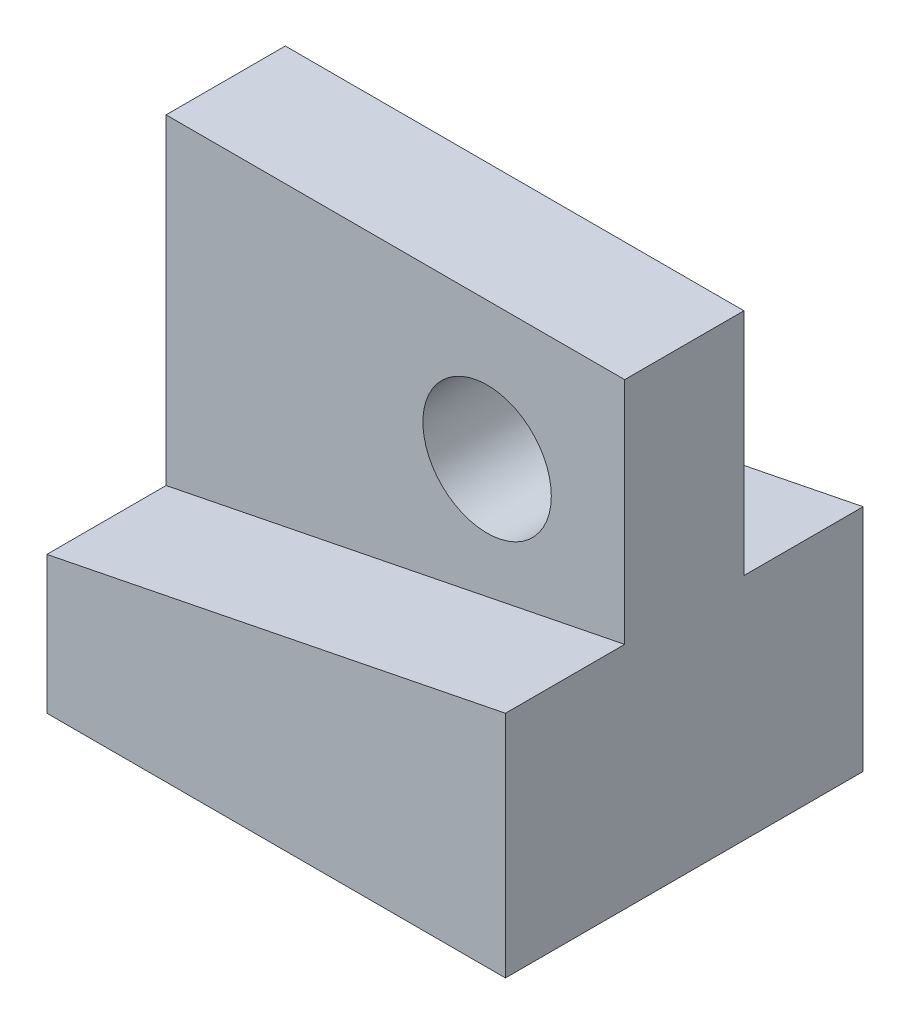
from build123d import *

# Parameters (mm, degrees)
SKETCH_1_W          = 50
SKETCH_1_H          = 50
EXTRUDE_1_DEPTH     = 19.5
CUT_EXTRUDE_1_DEPTH = 13
SKETCH_3_R          = 7
CUT_EXTRUDE_2_DEPTH = 13


with BuildPart() as part:
    # Sketch 1 → Extrude 1 (new, symmetric)
    with BuildSketch(Plane.XY):
        Rectangle(SKETCH_1_W, SKETCH_1_H)
    extrude(amount=EXTRUDE_1_DEPTH, both=True)

    # Sketch 2 → Cut-Extrude 1 (cut)
    with BuildSketch(Plane.XY.offset(19.5)):
        Polygon((25, 25), (-25, 25), (-25, -10), (25, 0), align=None)
    cut_extrude_1 = extrude(amount=-CUT_EXTRUDE_1_DEPTH, mode=Mode.SUBTRACT)

    # Mirror 1: Cut-Extrude 1 across plane
    add(cut_extrude_1.mirror(Plane.XY), mode=Mode.SUBTRACT)

    # Sketch 3 → Cut-Extrude 2 (cut)
    with BuildSketch(Plane.XY.offset(6.5)):
        with Locations((10, 10)):
            Circle(SKETCH_3_R)
    extrude(amount=-CUT_EXTRUDE_2_DEPTH, mode=Mode.SUBTRACT)


solid = part.part
